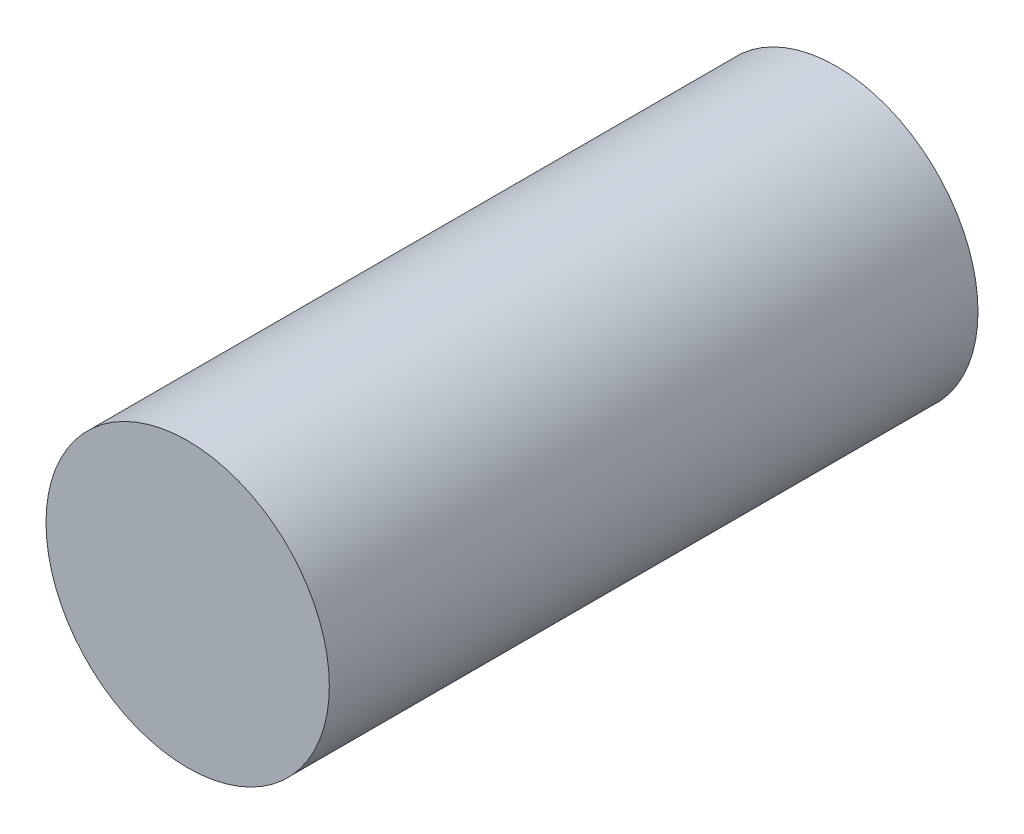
ISO-10303-21;
HEADER;
FILE_DESCRIPTION(('STEP AP214'),'2;1');
FILE_NAME('part.step','',(''),(''),'','','');
FILE_SCHEMA(('AUTOMOTIVE_DESIGN { 1 0 10303 214 1 1 1 1 }'));
ENDSEC;
DATA;
#1=APPLICATION_CONTEXT('core data for automotive mechanical design processes');
#2=APPLICATION_PROTOCOL_DEFINITION('international standard','automotive_design',2000,#1);
#3=PRODUCT_CONTEXT('',#1,'mechanical');
#4=PRODUCT('Part','Part','',(#3));
#5=PRODUCT_RELATED_PRODUCT_CATEGORY('part','',(#4));
#6=PRODUCT_DEFINITION_FORMATION('','',#4);
#7=PRODUCT_DEFINITION_CONTEXT('part definition',#1,'design');
#8=PRODUCT_DEFINITION('design','',#6,#7);
#9=PRODUCT_DEFINITION_SHAPE('','',#8);
#10=(LENGTH_UNIT() NAMED_UNIT(*) SI_UNIT(.MILLI.,.METRE.));
#11=(NAMED_UNIT(*) PLANE_ANGLE_UNIT() SI_UNIT($,.RADIAN.));
#12=(NAMED_UNIT(*) SI_UNIT($,.STERADIAN.) SOLID_ANGLE_UNIT());
#13=UNCERTAINTY_MEASURE_WITH_UNIT(LENGTH_MEASURE(1.E-05),#10,'distance_accuracy_value','');
#14=(GEOMETRIC_REPRESENTATION_CONTEXT(3) GLOBAL_UNCERTAINTY_ASSIGNED_CONTEXT((#13)) GLOBAL_UNIT_ASSIGNED_CONTEXT((#10,
#11,#12)) REPRESENTATION_CONTEXT('',''));
#15=CARTESIAN_POINT('',(0.,0.,0.));
#16=DIRECTION('',(0.,0.,1.));
#17=DIRECTION('',(1.,0.,0.));
#18=AXIS2_PLACEMENT_3D('',#15,#16,#17);
#19=CARTESIAN_POINT('',(-4.,4.,1.651));
#20=DIRECTION('',(0.,0.,-1.));
#21=DIRECTION('',(-1.,0.,0.));
#22=AXIS2_PLACEMENT_3D('',#19,#20,#21);
#23=CYLINDRICAL_SURFACE('',#22,0.360554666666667);
#24=CARTESIAN_POINT('',(-4.,4.,1.651));
#25=DIRECTION('',(0.,0.,1.));
#26=DIRECTION('',(1.,0.,0.));
#27=AXIS2_PLACEMENT_3D('',#24,#25,#26);
#28=CIRCLE('',#27,0.360554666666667);
#29=CARTESIAN_POINT('',(-3.63944533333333,4.,1.651));
#30=VERTEX_POINT('',#29);
#31=EDGE_CURVE('E10',#30,#30,#28,.T.);
#32=ORIENTED_EDGE('',*,*,#31,.F.);
#33=EDGE_LOOP('',(#32));
#34=FACE_BOUND('',#33,.T.);
#35=CARTESIAN_POINT('',(-4.,4.,0.));
#36=DIRECTION('',(0.,0.,1.));
#37=DIRECTION('',(1.,0.,0.));
#38=AXIS2_PLACEMENT_3D('',#35,#36,#37);
#39=CIRCLE('',#38,0.360554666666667);
#40=CARTESIAN_POINT('',(-3.63944533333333,4.,0.));
#41=VERTEX_POINT('',#40);
#42=EDGE_CURVE('E33',#41,#41,#39,.T.);
#43=ORIENTED_EDGE('',*,*,#42,.T.);
#44=EDGE_LOOP('',(#43));
#45=FACE_BOUND('',#44,.T.);
#46=ADVANCED_FACE('F30',(#34,#45),#23,.T.);
#47=CARTESIAN_POINT('',(-4.,4.,1.651));
#48=DIRECTION('',(0.,0.,1.));
#49=DIRECTION('',(1.,0.,0.));
#50=AXIS2_PLACEMENT_3D('',#47,#48,#49);
#51=PLANE('',#50);
#52=ORIENTED_EDGE('',*,*,#31,.T.);
#53=EDGE_LOOP('',(#52));
#54=FACE_BOUND('',#53,.T.);
#55=ADVANCED_FACE('F45',(#54),#51,.T.);
#56=CARTESIAN_POINT('',(-4.,4.,0.));
#57=DIRECTION('',(0.,0.,1.));
#58=DIRECTION('',(1.,0.,0.));
#59=AXIS2_PLACEMENT_3D('',#56,#57,#58);
#60=PLANE('',#59);
#61=ORIENTED_EDGE('',*,*,#42,.F.);
#62=EDGE_LOOP('',(#61));
#63=FACE_BOUND('',#62,.T.);
#64=ADVANCED_FACE('F43',(#63),#60,.F.);
#65=CLOSED_SHELL('',(#46,#55,#64));
#66=MANIFOLD_SOLID_BREP('B2',#65);
#67=ADVANCED_BREP_SHAPE_REPRESENTATION('',(#18,#66),#14);
#68=SHAPE_DEFINITION_REPRESENTATION(#9,#67);
ENDSEC;
END-ISO-10303-21;
